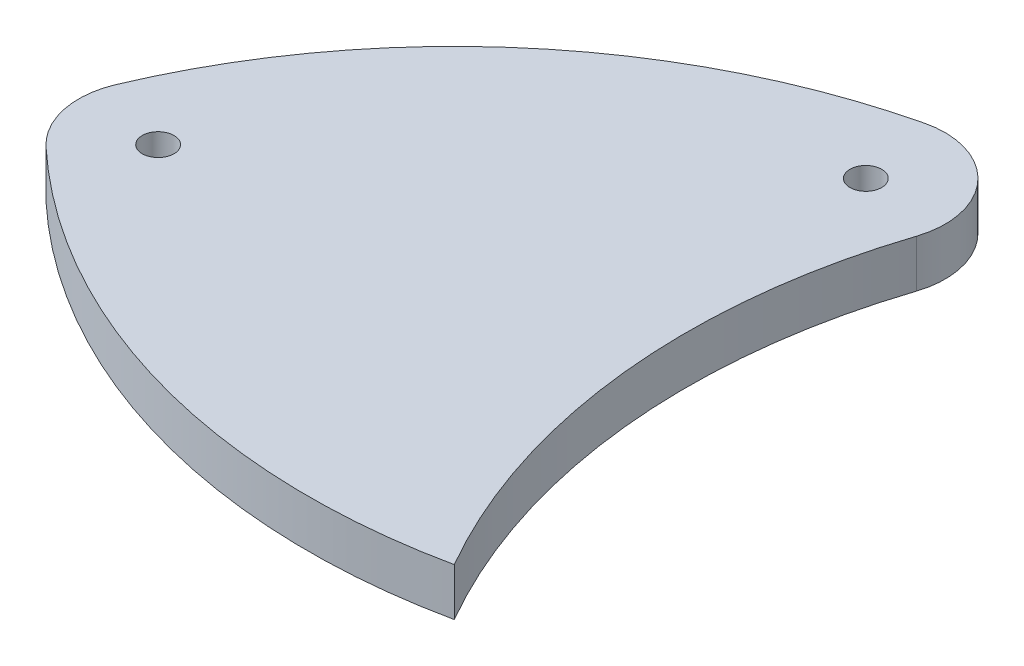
from build123d import *

# Parameters (mm, degrees)
ESQUISSE1_R        = 1
BOSS_EXTRU_1_DEPTH = 3


with BuildPart() as part:
    # Esquisse1 → Boss.-Extru.1 (new body)
    with BuildSketch(Plane(origin=(0, 0, 0), x_dir=(1, 0, 0), z_dir=(0, 1, 0))):
        with BuildLine():
            ThreePointArc((0, 0), (-5.14672626, 15.88471704), (-3.360114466, 32.486555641))
            ThreePointArc((-3.360114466, 32.486555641), (-4.430029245, 37.432036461), (-9.268863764, 38.911285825))
            ThreePointArc((-9.268863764, 38.911285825), (-25.857890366, 30.518347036), (-36.861011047, 15.532735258))
            ThreePointArc((-36.861011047, 15.532735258), (-37.14412267, 12.551584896), (-35.672944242, 9.943320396))
            ThreePointArc((-35.672944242, 9.943320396), (-19.056481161, 0.594720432), (0, 0))
        make_face()
        with Locations(Location((-32.253384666, 13.59114335, 0), (0, 0, 270))):
            Circle(ESQUISSE1_R, mode=Mode.SUBTRACT)
        with Locations(Location((-8.110255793, 34.047375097, 0), (0, 0, 270))):
            Circle(ESQUISSE1_R, mode=Mode.SUBTRACT)
    extrude(amount=BOSS_EXTRU_1_DEPTH)


solid = part.part
